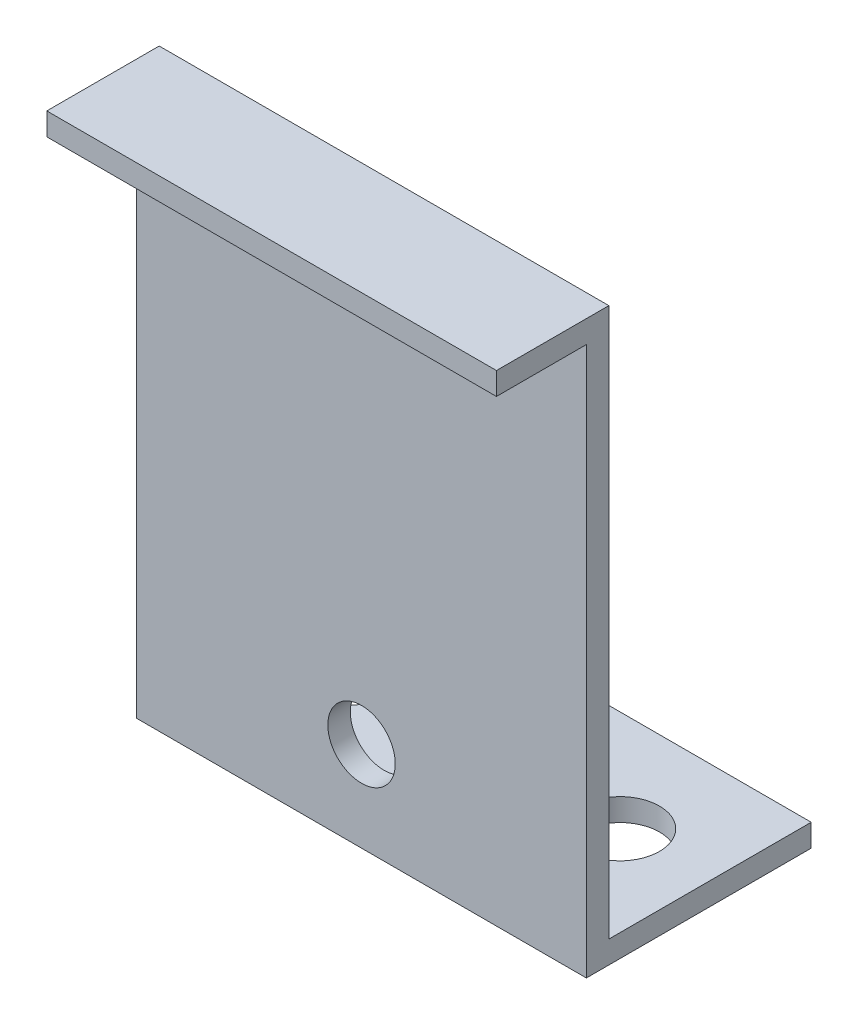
from build123d import *

# Parameters (mm, degrees)
EXTRUDE1_DEPTH = 20
SKETCH2_R      = 1.75
EXTRUDE2_DEPTH = 20
SKETCH3_R      = 1.5
EXTRUDE3_DEPTH = 20


with BuildPart() as part:
    # Sketch1 → Extrude1 (new body)
    with BuildSketch(Plane(origin=(0, 0, 0), x_dir=(0, 0, -1), z_dir=(1, 0, 0))):
        Polygon((10, 0), (0, 0), (0, 24.4), (-4, 24.4), (-4, 25.4), (1, 25.4), (1, 1), (10, 1), align=None)
    extrude(amount=EXTRUDE1_DEPTH)

    # Sketch2 → Extrude2 (cut)
    with BuildSketch(Plane(origin=(0, 1, 0), x_dir=(1, 0, 0), z_dir=(0, 1, 0))):
        with Locations(Location((4, 5.5, 0), (0, 0, 270))):
            Circle(SKETCH2_R)
        with Locations(Location((16, 5.5, 0), (0, 0, 270))):
            Circle(SKETCH2_R)
    extrude(amount=-EXTRUDE2_DEPTH, mode=Mode.SUBTRACT)

    # Sketch3 → Extrude3 (cut)
    with BuildSketch(Plane(origin=(0, 0, -1), x_dir=(-1, 0, 0), z_dir=(0, 0, -1))):
        with Locations((-10, 22.4)):
            Circle(SKETCH3_R)
        with Locations((-10, 4)):
            Circle(SKETCH3_R)
    extrude(amount=-EXTRUDE3_DEPTH, mode=Mode.SUBTRACT)


solid = part.part
